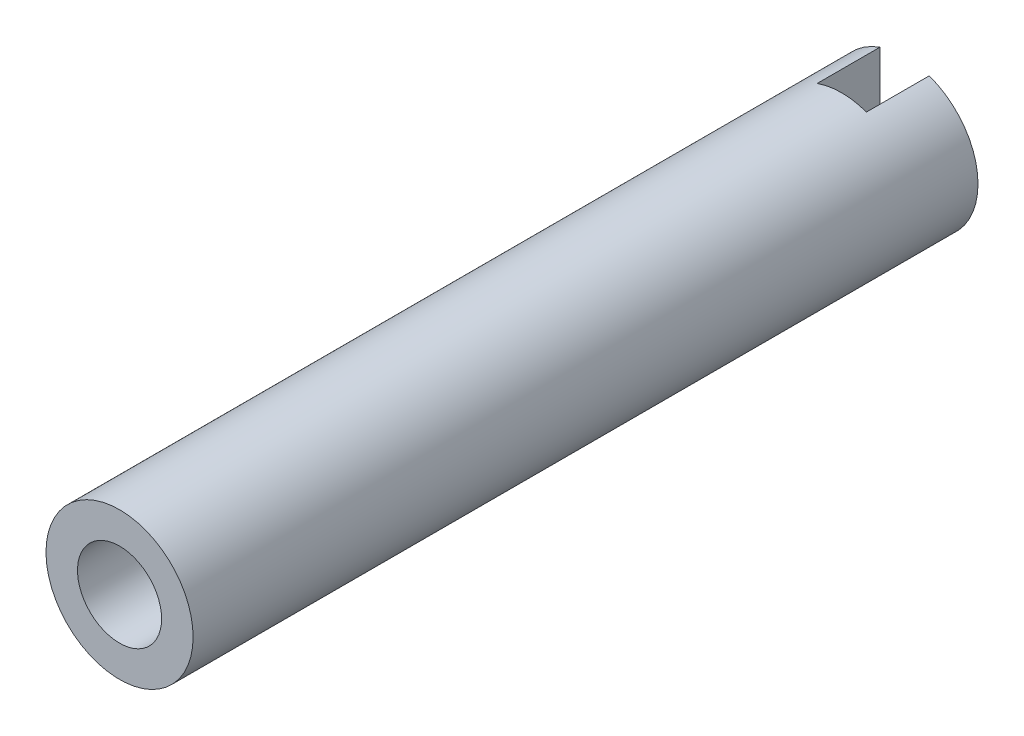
from build123d import *

# Parameters (mm, degrees)
SKETCH1_R           = 2.0828
BOSS_EXTRUDE1_DEPTH = 22.225
SKETCH3_W           = 1.397
SKETCH3_H           = 4.303246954
CUT_EXTRUDE1_DEPTH  = 1.778
SKETCH4_R           = 1.190625
CUT_EXTRUDE3_DEPTH  = 3.175
CHAMFER1_SIZE       = 1.190625


with BuildPart() as part:
    # Sketch1 → Boss-Extrude1 (new body)
    with BuildSketch(Plane.XY):
        Circle(SKETCH1_R)
    extrude(amount=BOSS_EXTRUDE1_DEPTH)

    # Sketch3 → Cut-Extrude1 (cut)
    with BuildSketch(Plane(origin=(0, 0, 0), x_dir=(-1, 0, 0), z_dir=(0, 0, -1))):
        with Locations((-0.004263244, 0)):
            Rectangle(SKETCH3_W, SKETCH3_H)
    extrude(amount=-CUT_EXTRUDE1_DEPTH, mode=Mode.SUBTRACT)

    # Sketch4 → Cut-Extrude3 (cut)
    with BuildSketch(Plane.XY.offset(22.225)):
        Circle(SKETCH4_R)
    extrude(amount=-CUT_EXTRUDE3_DEPTH, mode=Mode.SUBTRACT)

    # Chamfer1
    chamfer1_edges = [part.edges().sort_by_distance(p)[0] for p in [
        (-1.190625, 0, 19.05),
    ]]
    chamfer(chamfer1_edges, length=CHAMFER1_SIZE)


solid = part.part
